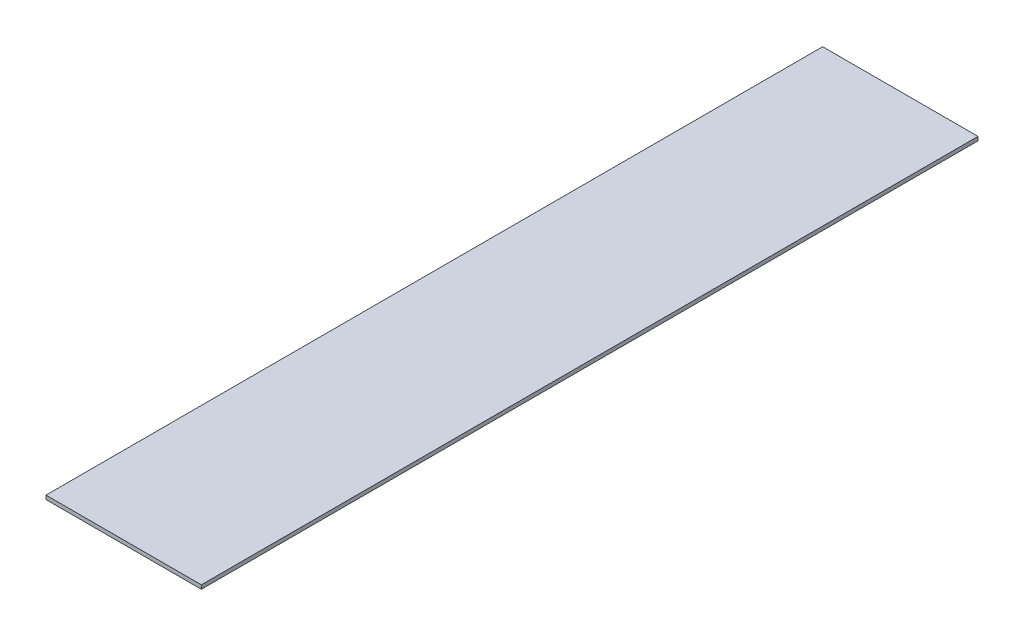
from build123d import *

# Parameters (mm, degrees)
SKIZZE1_W               = 20
SKIZZE1_H               = 0.5
LINEAR_AUSTRAGEN1_DEPTH = 100


with BuildPart() as part:
    # Skizze1 → Linear austragen1 (new body)
    with BuildSketch(Plane.XY):
        Rectangle(SKIZZE1_W, SKIZZE1_H)
    extrude(amount=LINEAR_AUSTRAGEN1_DEPTH)


solid = part.part
